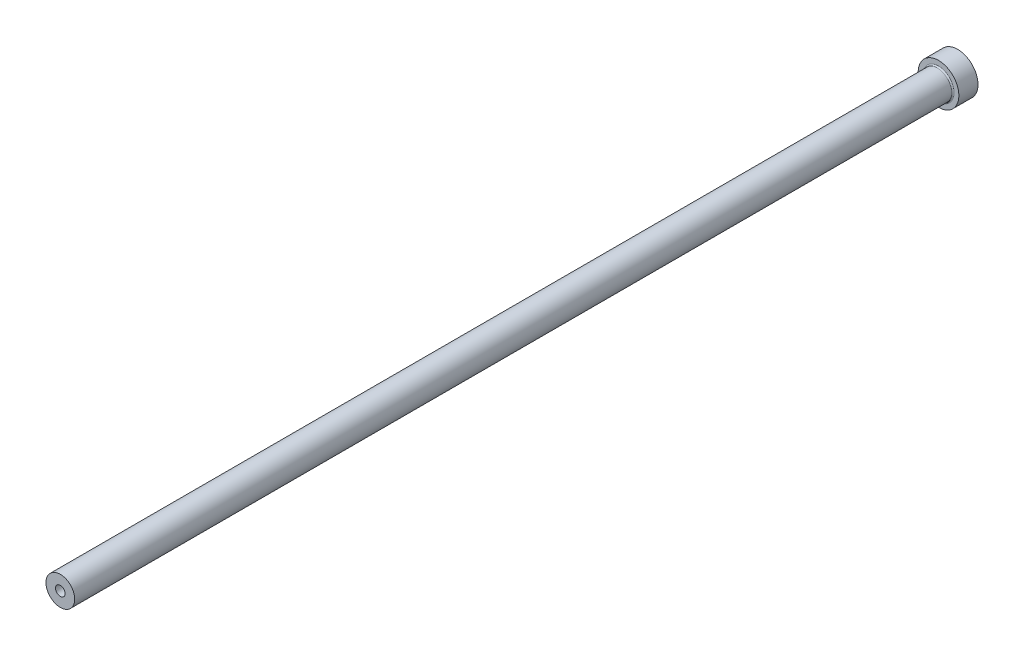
from build123d import *

# Parameters (mm, degrees)
HEAD_FILLET_R          = 0.5
ID_RELIEF_CHAMFER_SIZE = 0.5


with BuildPart() as part:
    # OD FV → Base Revolve (revolve)
    with BuildSketch(Plane(origin=(0, 0, 0), x_dir=(1, 0, 0), z_dir=(0, 1, 0))):
        Polygon((0, -375), (6, -375), (6, -8), (8.5, -8), (8.5, 0), (0, 0), align=None)
    revolve(axis=Axis((0, 0, 375), (0, 0, -1)))

    # ID FV → Hole (revolve, cut)
    with BuildSketch(Plane(origin=(0, 0, 0), x_dir=(1, 0, 0), z_dir=(0, 1, 0))):
        Polygon((0, -375), (2, -375), (2, -225), (2.25, -224.566987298), (2.25, 0), (0, 0), align=None)
    revolve(axis=Axis((0, 0, 375), (0, 0, -1)), mode=Mode.SUBTRACT)

    # Head Fillet
    head_fillet_edges = [part.edges().sort_by_distance(p)[0] for p in [
        (-6, 0, 8),
    ]]
    fillet(head_fillet_edges, radius=HEAD_FILLET_R)

    # ID Relief Chamfer
    id_relief_chamfer_edges = [part.edges().sort_by_distance(p)[0] for p in [
        (-2.25, 0, 0),
    ]]
    chamfer(id_relief_chamfer_edges, length=ID_RELIEF_CHAMFER_SIZE)


solid = part.part
